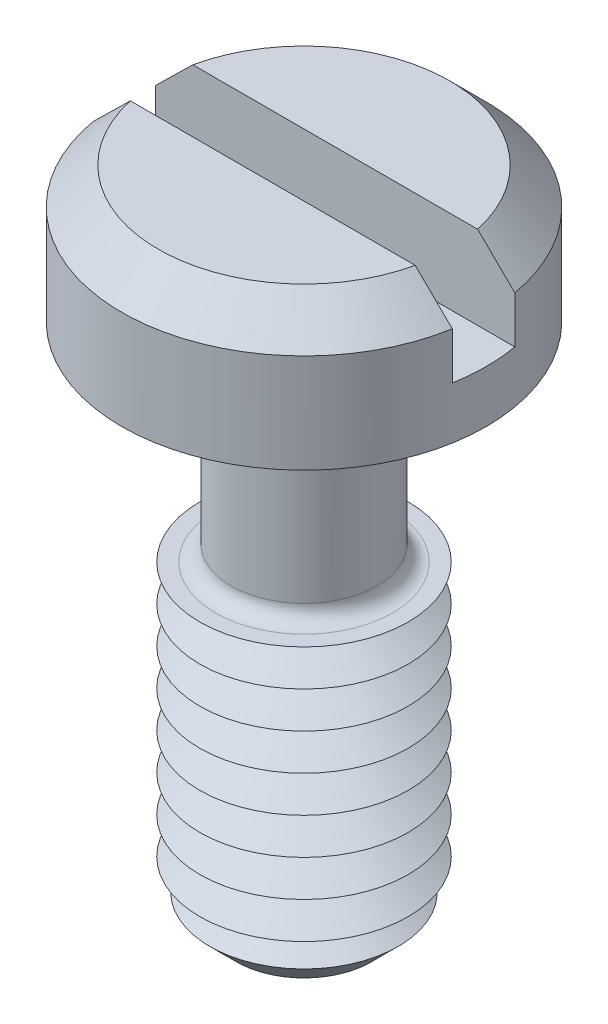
ISO-10303-21;
HEADER;
FILE_DESCRIPTION(('STEP AP214'),'2;1');
FILE_NAME('part.step','',(''),(''),'','','');
FILE_SCHEMA(('AUTOMOTIVE_DESIGN { 1 0 10303 214 1 1 1 1 }'));
ENDSEC;
DATA;
#1=APPLICATION_CONTEXT('core data for automotive mechanical design processes');
#2=APPLICATION_PROTOCOL_DEFINITION('international standard','automotive_design',2000,#1);
#3=PRODUCT_CONTEXT('',#1,'mechanical');
#4=PRODUCT('Part','Part','',(#3));
#5=PRODUCT_RELATED_PRODUCT_CATEGORY('part','',(#4));
#6=PRODUCT_DEFINITION_FORMATION('','',#4);
#7=PRODUCT_DEFINITION_CONTEXT('part definition',#1,'design');
#8=PRODUCT_DEFINITION('design','',#6,#7);
#9=PRODUCT_DEFINITION_SHAPE('','',#8);
#10=(LENGTH_UNIT() NAMED_UNIT(*) SI_UNIT(.MILLI.,.METRE.));
#11=(NAMED_UNIT(*) PLANE_ANGLE_UNIT() SI_UNIT($,.RADIAN.));
#12=(NAMED_UNIT(*) SI_UNIT($,.STERADIAN.) SOLID_ANGLE_UNIT());
#13=UNCERTAINTY_MEASURE_WITH_UNIT(LENGTH_MEASURE(1.E-05),#10,'distance_accuracy_value','');
#14=(GEOMETRIC_REPRESENTATION_CONTEXT(3) GLOBAL_UNCERTAINTY_ASSIGNED_CONTEXT((#13)) GLOBAL_UNIT_ASSIGNED_CONTEXT((#10,
#11,#12)) REPRESENTATION_CONTEXT('',''));
#15=CARTESIAN_POINT('',(0.,0.,0.));
#16=DIRECTION('',(0.,0.,1.));
#17=DIRECTION('',(1.,0.,0.));
#18=AXIS2_PLACEMENT_3D('',#15,#16,#17);
#19=CARTESIAN_POINT('',(0.,2.6,0.));
#20=DIRECTION('',(0.,1.,0.));
#21=DIRECTION('',(0.,0.,1.));
#22=AXIS2_PLACEMENT_3D('',#19,#20,#21);
#23=PLANE('',#22);
#24=DIRECTION('',(-1.,0.,0.));
#25=VECTOR('',#24,1.);
#26=CARTESIAN_POINT('',(3.5,2.6,-0.6));
#27=LINE('',#26,#25);
#28=CARTESIAN_POINT('',(2.73495886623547,2.6,-0.6));
#29=VERTEX_POINT('',#28);
#30=CARTESIAN_POINT('',(-2.73495886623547,2.6,-0.6));
#31=VERTEX_POINT('',#30);
#32=EDGE_CURVE('E110',#29,#31,#27,.T.);
#33=ORIENTED_EDGE('',*,*,#32,.F.);
#34=CARTESIAN_POINT('',(0.,2.6,0.));
#35=DIRECTION('',(0.,1.,0.));
#36=DIRECTION('',(0.,0.,1.));
#37=AXIS2_PLACEMENT_3D('',#34,#35,#36);
#38=CIRCLE('',#37,2.8);
#39=EDGE_CURVE('E113',#29,#31,#38,.T.);
#40=ORIENTED_EDGE('',*,*,#39,.T.);
#41=EDGE_LOOP('',(#33,#40));
#42=FACE_BOUND('',#41,.T.);
#43=ADVANCED_FACE('F39',(#42),#23,.T.);
#44=CARTESIAN_POINT('',(0.,2.6,0.));
#45=DIRECTION('',(0.,-1.,0.));
#46=DIRECTION('',(0.,0.,-1.));
#47=AXIS2_PLACEMENT_3D('',#44,#45,#46);
#48=CONICAL_SURFACE('',#47,2.8,0.785398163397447);
#49=CARTESIAN_POINT('',(7.69779986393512,-2.32114776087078,-0.6));
#50=CARTESIAN_POINT('',(7.42456340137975,-2.0487448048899,-0.6));
#51=CARTESIAN_POINT('',(7.15128998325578,-1.77637887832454,-0.6));
#52=CARTESIAN_POINT('',(6.60460779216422,-1.23176088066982,-0.6));
#53=CARTESIAN_POINT('',(6.33119901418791,-0.959508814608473,-0.6));
#54=CARTESIAN_POINT('',(5.78393918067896,-0.414914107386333,-0.6));
#55=CARTESIAN_POINT('',(5.5100879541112,-0.14257163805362,-0.6));
#56=CARTESIAN_POINT('',(4.9621249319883,0.401829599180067,-0.6));
#57=CARTESIAN_POINT('',(4.68801314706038,0.673888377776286,-0.6));
#58=CARTESIAN_POINT('',(4.15230810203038,1.20471714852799,-0.6));
#59=CARTESIAN_POINT('',(3.89073524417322,1.4635077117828,-0.6));
#60=CARTESIAN_POINT('',(3.49781694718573,1.85115830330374,-0.6));
#61=CARTESIAN_POINT('',(3.36674319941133,1.98029362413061,-0.6));
#62=CARTESIAN_POINT('',(3.10433907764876,2.23830030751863,-0.6));
#63=CARTESIAN_POINT('',(2.97300870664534,2.36717167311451,-0.6));
#64=CARTESIAN_POINT('',(2.71005235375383,2.62445652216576,-0.6));
#65=CARTESIAN_POINT('',(2.57842659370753,2.75287023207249,-0.6));
#66=CARTESIAN_POINT('',(2.31459302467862,3.00911021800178,-0.6));
#67=CARTESIAN_POINT('',(2.1823851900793,3.13693646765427,-0.6));
#68=CARTESIAN_POINT('',(1.91706128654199,3.39159289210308,-0.6));
#69=CARTESIAN_POINT('',(1.78394541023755,3.51842326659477,-0.6));
#70=CARTESIAN_POINT('',(1.5829745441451,3.70728046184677,-0.6));
#71=CARTESIAN_POINT('',(1.51577053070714,3.76999922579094,-0.6));
#72=CARTESIAN_POINT('',(1.38073587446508,3.89475766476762,-0.6));
#73=CARTESIAN_POINT('',(1.31290524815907,3.95679735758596,-0.6));
#74=CARTESIAN_POINT('',(1.20662362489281,4.05253127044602,-0.6));
#75=CARTESIAN_POINT('',(1.16849592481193,4.08658409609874,-0.6));
#76=CARTESIAN_POINT('',(1.09186306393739,4.15427097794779,-0.6));
#77=CARTESIAN_POINT('',(1.05335786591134,4.18790499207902,-0.6));
#78=CARTESIAN_POINT('',(0.975560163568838,4.25487029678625,-0.6));
#79=CARTESIAN_POINT('',(0.936263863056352,4.28819718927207,-0.6));
#80=CARTESIAN_POINT('',(0.857023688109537,4.35405392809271,-0.6));
#81=CARTESIAN_POINT('',(0.817079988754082,4.38658398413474,-0.6));
#82=CARTESIAN_POINT('',(0.735932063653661,4.45080389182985,-0.6));
#83=CARTESIAN_POINT('',(0.694719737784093,4.48248357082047,-0.6));
#84=CARTESIAN_POINT('',(0.611023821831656,4.54411116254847,-0.6));
#85=CARTESIAN_POINT('',(0.568540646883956,4.57405963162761,-0.6));
#86=CARTESIAN_POINT('',(0.482031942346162,4.63104137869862,-0.6));
#87=CARTESIAN_POINT('',(0.438018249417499,4.65809235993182,-0.6));
#88=CARTESIAN_POINT('',(0.347545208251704,4.70764477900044,-0.6));
#89=CARTESIAN_POINT('',(0.301093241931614,4.73015905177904,-0.6));
#90=CARTESIAN_POINT('',(0.21684063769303,4.76288589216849,-0.6));
#91=CARTESIAN_POINT('',(0.179711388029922,4.77476119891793,-0.6));
#92=CARTESIAN_POINT('',(0.104069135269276,4.79214056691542,-0.6));
#93=CARTESIAN_POINT('',(0.0655630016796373,4.79767265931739,-0.6));
#94=CARTESIAN_POINT('',(-0.0121083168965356,4.80113734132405,-0.6));
#95=CARTESIAN_POINT('',(-0.051276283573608,4.79901215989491,-0.6));
#96=CARTESIAN_POINT('',(-0.128601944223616,4.78758103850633,-0.6));
#97=CARTESIAN_POINT('',(-0.166755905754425,4.77825158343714,-0.6));
#98=CARTESIAN_POINT('',(-0.239985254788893,4.75468984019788,-0.6));
#99=CARTESIAN_POINT('',(-0.275121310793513,4.74063623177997,-0.6));
#100=CARTESIAN_POINT('',(-0.343859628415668,4.70912771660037,-0.6));
#101=CARTESIAN_POINT('',(-0.377459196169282,4.6916670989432,-0.6));
#102=CARTESIAN_POINT('',(-0.443620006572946,4.65431398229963,-0.6));
#103=CARTESIAN_POINT('',(-0.476170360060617,4.63440256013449,-0.6));
#104=CARTESIAN_POINT('',(-0.540208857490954,4.59301144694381,-0.6));
#105=CARTESIAN_POINT('',(-0.571697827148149,4.57153301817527,-0.6));
#106=CARTESIAN_POINT('',(-0.636426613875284,4.5256571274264,-0.6));
#107=CARTESIAN_POINT('',(-0.669598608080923,4.50116466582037,-0.6));
#108=CARTESIAN_POINT('',(-0.735238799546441,4.45125092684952,-0.6));
#109=CARTESIAN_POINT('',(-0.767706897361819,4.42582951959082,-0.6));
#110=CARTESIAN_POINT('',(-0.864340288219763,4.34853769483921,-0.6));
#111=CARTESIAN_POINT('',(-0.927700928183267,4.29566444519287,-0.6));
#112=CARTESIAN_POINT('',(-1.05322030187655,4.18829389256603,-0.6));
#113=CARTESIAN_POINT('',(-1.11537654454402,4.13379371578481,-0.6));
#114=CARTESIAN_POINT('',(-1.23879800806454,4.02383276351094,-0.6));
#115=CARTESIAN_POINT('',(-1.30006349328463,3.96837228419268,-0.6));
#116=CARTESIAN_POINT('',(-1.42182653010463,3.85695373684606,-0.6));
#117=CARTESIAN_POINT('',(-1.48232573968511,3.80099747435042,-0.6));
#118=CARTESIAN_POINT('',(-1.602900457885,3.68862177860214,-0.6));
#119=CARTESIAN_POINT('',(-1.66297593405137,3.63220231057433,-0.6));
#120=CARTESIAN_POINT('',(-1.84259490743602,3.46258196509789,-0.6));
#121=CARTESIAN_POINT('',(-1.96167258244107,3.34888831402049,-0.6));
#122=CARTESIAN_POINT('',(-2.19942862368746,3.12043467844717,-0.6));
#123=CARTESIAN_POINT('',(-2.31810499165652,3.00567262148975,-0.6));
#124=CARTESIAN_POINT('',(-2.55498513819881,2.77566147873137,-0.6));
#125=CARTESIAN_POINT('',(-2.67318891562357,2.66041239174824,-0.6));
#126=CARTESIAN_POINT('',(-3.02733776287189,2.31418176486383,-0.6));
#127=CARTESIAN_POINT('',(-3.26281496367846,2.08272206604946,-0.6));
#128=CARTESIAN_POINT('',(-3.7332660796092,1.61902814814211,-0.6));
#129=CARTESIAN_POINT('',(-3.96823963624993,1.38679356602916,-0.6));
#130=CARTESIAN_POINT('',(-4.43780370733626,0.921942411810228,-0.6));
#131=CARTESIAN_POINT('',(-4.67239422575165,0.689325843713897,-0.6));
#132=CARTESIAN_POINT('',(-5.13982382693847,0.225350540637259,-0.6));
#133=CARTESIAN_POINT('',(-5.37266445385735,-0.00600663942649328,-0.6));
#134=CARTESIAN_POINT('',(-5.83818541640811,-0.468883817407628,-0.6));
#135=CARTESIAN_POINT('',(-6.07086575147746,-0.700403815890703,-0.6));
#136=CARTESIAN_POINT('',(-6.53596926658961,-1.16341429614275,-0.6));
#137=CARTESIAN_POINT('',(-6.76839251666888,-1.39490470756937,-0.6));
#138=CARTESIAN_POINT('',(-7.23315324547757,-1.85796986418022,-0.6));
#139=CARTESIAN_POINT('',(-7.46549072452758,-2.08954460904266,-0.6));
#140=CARTESIAN_POINT('',(-7.69779986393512,-2.32114776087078,-0.6));
#141=B_SPLINE_CURVE_WITH_KNOTS('',3,(#49,#50,#51,#52,#53,#54,#55,#56,#57,#58,#59,#60,#61,#62,
#63,#64,#65,#66,#67,#68,#69,#70,#71,#72,#73,#74,#75,#76,#77,#78,#79,#80,#81,#82,#83,#84,#85,#86,
#87,#88,#89,#90,#91,#92,#93,#94,#95,#96,#97,#98,#99,#100,#101,#102,#103,#104,#105,#106,#107,
#108,#109,#110,#111,#112,#113,#114,#115,#116,#117,#118,#119,#120,#121,#122,#123,#124,#125,#126,
#127,#128,#129,#130,#131,#132,#133,#134,#135,#136,#137,#138,#139,#140),.UNSPECIFIED.,.F.,.F.,(4,
2,2,2,2,2,2,2,2,2,2,2,2,2,2,2,2,2,2,2,2,2,2,2,2,2,2,2,2,2,2,2,2,2,2,2,2,2,2,2,2,2,2,2,2,4),(0.,
1.15747738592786,2.31500139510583,3.47365747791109,4.6322681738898,5.73614050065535,
6.28814234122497,6.84013779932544,7.39180548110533,7.94349768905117,8.49507629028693,
8.77084567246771,9.04660781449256,9.19996738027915,9.35334222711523,9.50791164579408,
9.66243993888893,9.81835637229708,9.9742224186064,10.1290741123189,10.2834813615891,
10.4000294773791,10.5160605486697,10.6329688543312,10.7502603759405,10.8635386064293,
10.9770083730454,11.0914168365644,11.205734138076,11.3294140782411,11.4531113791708,
11.7006314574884,11.9486181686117,12.1965297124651,12.4437540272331,12.6909970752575,
13.184904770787,13.6801705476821,14.1754375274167,15.1659939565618,16.1571087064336,
17.1482131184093,18.1329303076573,19.1176509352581,20.1017623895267,21.0858701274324),.UNSPECIFIED.);
#142=CARTESIAN_POINT('',(3.44818792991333,1.9,-0.6));
#143=VERTEX_POINT('',#142);
#144=EDGE_CURVE('E260',#143,#29,#141,.T.);
#145=ORIENTED_EDGE('',*,*,#144,.F.);
#146=CARTESIAN_POINT('',(0.,1.9,0.));
#147=DIRECTION('',(0.,1.,0.));
#148=DIRECTION('',(0.,0.,1.));
#149=AXIS2_PLACEMENT_3D('',#146,#147,#148);
#150=CIRCLE('',#149,3.5);
#151=CARTESIAN_POINT('',(-3.44818792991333,1.9,-0.6));
#152=VERTEX_POINT('',#151);
#153=EDGE_CURVE('E128',#152,#143,#150,.F.);
#154=ORIENTED_EDGE('',*,*,#153,.F.);
#155=EDGE_CURVE('E102',#31,#152,#141,.T.);
#156=ORIENTED_EDGE('',*,*,#155,.F.);
#157=ORIENTED_EDGE('',*,*,#39,.F.);
#158=EDGE_LOOP('',(#145,#154,#156,#157));
#159=FACE_BOUND('',#158,.T.);
#160=ADVANCED_FACE('F222',(#159),#48,.T.);
#161=CARTESIAN_POINT('',(0.,-10.,0.));
#162=DIRECTION('',(0.,1.,0.));
#163=DIRECTION('',(0.,0.,1.));
#164=AXIS2_PLACEMENT_3D('',#161,#162,#163);
#165=CYLINDRICAL_SURFACE('',#164,1.4);
#166=CARTESIAN_POINT('',(0.,-3.7,0.));
#167=DIRECTION('',(0.,-1.,0.));
#168=DIRECTION('',(0.,0.,-1.));
#169=AXIS2_PLACEMENT_3D('',#166,#167,#168);
#170=CIRCLE('',#169,1.4);
#171=CARTESIAN_POINT('',(0.,-3.7,-1.4));
#172=VERTEX_POINT('',#171);
#173=EDGE_CURVE('E123',#172,#172,#170,.F.);
#174=ORIENTED_EDGE('',*,*,#173,.T.);
#175=EDGE_LOOP('',(#174));
#176=FACE_BOUND('',#175,.T.);
#177=CARTESIAN_POINT('',(0.,-0.3,0.));
#178=DIRECTION('',(0.,1.,0.));
#179=DIRECTION('',(0.,0.,1.));
#180=AXIS2_PLACEMENT_3D('',#177,#178,#179);
#181=CIRCLE('',#180,1.4);
#182=CARTESIAN_POINT('',(0.,-0.3,1.4));
#183=VERTEX_POINT('',#182);
#184=EDGE_CURVE('E365',#183,#183,#181,.F.);
#185=ORIENTED_EDGE('',*,*,#184,.T.);
#186=EDGE_LOOP('',(#185));
#187=FACE_BOUND('',#186,.T.);
#188=ADVANCED_FACE('F218',(#176,#187),#165,.T.);
#189=CARTESIAN_POINT('',(0.,2.6,0.));
#190=DIRECTION('',(0.,-1.,0.));
#191=DIRECTION('',(0.,0.,-1.));
#192=AXIS2_PLACEMENT_3D('',#189,#190,#191);
#193=CYLINDRICAL_SURFACE('',#192,3.5);
#194=ORIENTED_EDGE('',*,*,#153,.T.);
#195=DIRECTION('',(0.,-1.,0.));
#196=VECTOR('',#195,1.);
#197=CARTESIAN_POINT('',(3.44818792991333,2.6,-0.6));
#198=LINE('',#197,#196);
#199=CARTESIAN_POINT('',(3.44818792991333,1.,-0.6));
#200=VERTEX_POINT('',#199);
#201=EDGE_CURVE('E64',#143,#200,#198,.T.);
#202=ORIENTED_EDGE('',*,*,#201,.T.);
#203=CARTESIAN_POINT('',(0.,1.,0.));
#204=DIRECTION('',(0.,1.,0.));
#205=DIRECTION('',(0.,0.,1.));
#206=AXIS2_PLACEMENT_3D('',#203,#204,#205);
#207=CIRCLE('',#206,3.5);
#208=CARTESIAN_POINT('',(3.44818792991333,1.,0.6));
#209=VERTEX_POINT('',#208);
#210=EDGE_CURVE('E11',#209,#200,#207,.T.);
#211=ORIENTED_EDGE('',*,*,#210,.F.);
#212=DIRECTION('',(0.,-1.,0.));
#213=VECTOR('',#212,1.);
#214=CARTESIAN_POINT('',(3.44818792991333,2.6,0.6));
#215=LINE('',#214,#213);
#216=CARTESIAN_POINT('',(3.44818792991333,1.9,0.6));
#217=VERTEX_POINT('',#216);
#218=EDGE_CURVE('E275',#209,#217,#215,.F.);
#219=ORIENTED_EDGE('',*,*,#218,.T.);
#220=CARTESIAN_POINT('',(-3.44818792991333,1.9,0.6));
#221=VERTEX_POINT('',#220);
#222=EDGE_CURVE('E120',#217,#221,#150,.F.);
#223=ORIENTED_EDGE('',*,*,#222,.T.);
#224=DIRECTION('',(0.,-1.,0.));
#225=VECTOR('',#224,1.);
#226=CARTESIAN_POINT('',(-3.44818792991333,2.6,0.6));
#227=LINE('',#226,#225);
#228=CARTESIAN_POINT('',(-3.44818792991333,1.,0.6));
#229=VERTEX_POINT('',#228);
#230=EDGE_CURVE('E96',#221,#229,#227,.T.);
#231=ORIENTED_EDGE('',*,*,#230,.T.);
#232=CARTESIAN_POINT('',(-3.44818792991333,1.,-0.6));
#233=VERTEX_POINT('',#232);
#234=EDGE_CURVE('E44',#233,#229,#207,.T.);
#235=ORIENTED_EDGE('',*,*,#234,.F.);
#236=DIRECTION('',(0.,-1.,0.));
#237=VECTOR('',#236,1.);
#238=CARTESIAN_POINT('',(-3.44818792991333,2.6,-0.6));
#239=LINE('',#238,#237);
#240=EDGE_CURVE('E280',#233,#152,#239,.F.);
#241=ORIENTED_EDGE('',*,*,#240,.T.);
#242=EDGE_LOOP('',(#194,#202,#211,#219,#223,#231,#235,#241));
#243=FACE_BOUND('',#242,.T.);
#244=CARTESIAN_POINT('',(0.,0.,0.));
#245=DIRECTION('',(0.,1.,0.));
#246=DIRECTION('',(0.,0.,1.));
#247=AXIS2_PLACEMENT_3D('',#244,#245,#246);
#248=CIRCLE('',#247,3.5);
#249=CARTESIAN_POINT('',(0.,0.,3.5));
#250=VERTEX_POINT('',#249);
#251=EDGE_CURVE('E351',#250,#250,#248,.T.);
#252=ORIENTED_EDGE('',*,*,#251,.T.);
#253=EDGE_LOOP('',(#252));
#254=FACE_BOUND('',#253,.T.);
#255=ADVANCED_FACE('F221',(#243,#254),#193,.T.);
#256=DIRECTION('',(1.,0.,0.));
#257=VECTOR('',#256,1.);
#258=CARTESIAN_POINT('',(3.5,2.6,0.6));
#259=LINE('',#258,#257);
#260=CARTESIAN_POINT('',(-2.73495886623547,2.6,0.6));
#261=VERTEX_POINT('',#260);
#262=CARTESIAN_POINT('',(2.73495886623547,2.6,0.6));
#263=VERTEX_POINT('',#262);
#264=EDGE_CURVE('E56',#261,#263,#259,.T.);
#265=ORIENTED_EDGE('',*,*,#264,.F.);
#266=EDGE_CURVE('E108',#261,#263,#38,.T.);
#267=ORIENTED_EDGE('',*,*,#266,.T.);
#268=EDGE_LOOP('',(#265,#267));
#269=FACE_BOUND('',#268,.T.);
#270=ADVANCED_FACE('F107',(#269),#23,.T.);
#271=CARTESIAN_POINT('',(0.,0.,0.));
#272=DIRECTION('',(0.,1.,0.));
#273=DIRECTION('',(0.,0.,1.));
#274=AXIS2_PLACEMENT_3D('',#271,#272,#273);
#275=PLANE('',#274);
#276=CARTESIAN_POINT('',(0.,0.,0.));
#277=DIRECTION('',(0.,1.,0.));
#278=DIRECTION('',(0.,0.,1.));
#279=AXIS2_PLACEMENT_3D('',#276,#277,#278);
#280=CIRCLE('',#279,1.7);
#281=CARTESIAN_POINT('',(0.,0.,1.7));
#282=VERTEX_POINT('',#281);
#283=EDGE_CURVE('E114',#282,#282,#280,.T.);
#284=ORIENTED_EDGE('',*,*,#283,.T.);
#285=EDGE_LOOP('',(#284));
#286=FACE_BOUND('',#285,.T.);
#287=ORIENTED_EDGE('',*,*,#251,.F.);
#288=EDGE_LOOP('',(#287));
#289=FACE_BOUND('',#288,.T.);
#290=ADVANCED_FACE('F212',(#286,#289),#275,.F.);
#291=CARTESIAN_POINT('',(0.,-4.,0.));
#292=DIRECTION('',(0.,-1.,0.));
#293=DIRECTION('',(0.,0.,-1.));
#294=AXIS2_PLACEMENT_3D('',#291,#292,#293);
#295=PLANE('',#294);
#296=CARTESIAN_POINT('',(0.,-4.,0.));
#297=DIRECTION('',(0.,-1.,0.));
#298=DIRECTION('',(0.,0.,-1.));
#299=AXIS2_PLACEMENT_3D('',#296,#297,#298);
#300=CIRCLE('',#299,1.7);
#301=CARTESIAN_POINT('',(0.,-4.,-1.7));
#302=VERTEX_POINT('',#301);
#303=EDGE_CURVE('E359',#302,#302,#300,.T.);
#304=ORIENTED_EDGE('',*,*,#303,.T.);
#305=EDGE_LOOP('',(#304));
#306=FACE_BOUND('',#305,.T.);
#307=CARTESIAN_POINT('',(0.,-4.,0.));
#308=DIRECTION('',(0.,1.,0.));
#309=DIRECTION('',(0.,0.,1.));
#310=AXIS2_PLACEMENT_3D('',#307,#308,#309);
#311=CIRCLE('',#310,2.);
#312=CARTESIAN_POINT('',(0.,-4.,2.));
#313=VERTEX_POINT('',#312);
#314=EDGE_CURVE('E347',#313,#313,#311,.T.);
#315=ORIENTED_EDGE('',*,*,#314,.T.);
#316=EDGE_LOOP('',(#315));
#317=FACE_BOUND('',#316,.T.);
#318=ADVANCED_FACE('F208',(#306,#317),#295,.F.);
#319=CARTESIAN_POINT('',(0.,-4.35,0.));
#320=DIRECTION('',(0.,1.,0.));
#321=DIRECTION('',(0.,0.,1.));
#322=AXIS2_PLACEMENT_3D('',#319,#320,#321);
#323=CONICAL_SURFACE('',#322,1.39378221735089,1.0471975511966);
#324=ORIENTED_EDGE('',*,*,#314,.F.);
#325=EDGE_LOOP('',(#324));
#326=FACE_BOUND('',#325,.T.);
#327=CARTESIAN_POINT('',(0.,-4.35,0.));
#328=DIRECTION('',(0.,1.,0.));
#329=DIRECTION('',(0.,0.,1.));
#330=AXIS2_PLACEMENT_3D('',#327,#328,#329);
#331=CIRCLE('',#330,1.39378221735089);
#332=CARTESIAN_POINT('',(0.,-4.35,1.39378221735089));
#333=VERTEX_POINT('',#332);
#334=EDGE_CURVE('E343',#333,#333,#331,.T.);
#335=ORIENTED_EDGE('',*,*,#334,.T.);
#336=EDGE_LOOP('',(#335));
#337=FACE_BOUND('',#336,.T.);
#338=ADVANCED_FACE('F204',(#326,#337),#323,.T.);
#339=CARTESIAN_POINT('',(0.,-4.7,0.));
#340=DIRECTION('',(0.,-1.,0.));
#341=DIRECTION('',(0.,0.,-1.));
#342=AXIS2_PLACEMENT_3D('',#339,#340,#341);
#343=CONICAL_SURFACE('',#342,2.,1.0471975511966);
#344=ORIENTED_EDGE('',*,*,#334,.F.);
#345=EDGE_LOOP('',(#344));
#346=FACE_BOUND('',#345,.T.);
#347=CARTESIAN_POINT('',(0.,-4.7,0.));
#348=DIRECTION('',(0.,1.,0.));
#349=DIRECTION('',(0.,0.,1.));
#350=AXIS2_PLACEMENT_3D('',#347,#348,#349);
#351=CIRCLE('',#350,2.);
#352=CARTESIAN_POINT('',(0.,-4.7,2.));
#353=VERTEX_POINT('',#352);
#354=EDGE_CURVE('E339',#353,#353,#351,.T.);
#355=ORIENTED_EDGE('',*,*,#354,.T.);
#356=EDGE_LOOP('',(#355));
#357=FACE_BOUND('',#356,.T.);
#358=ADVANCED_FACE('F200',(#346,#357),#343,.T.);
#359=CARTESIAN_POINT('',(0.,-5.05,0.));
#360=DIRECTION('',(0.,1.,0.));
#361=DIRECTION('',(0.,0.,1.));
#362=AXIS2_PLACEMENT_3D('',#359,#360,#361);
#363=CONICAL_SURFACE('',#362,1.39378221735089,1.0471975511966);
#364=ORIENTED_EDGE('',*,*,#354,.F.);
#365=EDGE_LOOP('',(#364));
#366=FACE_BOUND('',#365,.T.);
#367=CARTESIAN_POINT('',(0.,-5.05,0.));
#368=DIRECTION('',(0.,1.,0.));
#369=DIRECTION('',(0.,0.,1.));
#370=AXIS2_PLACEMENT_3D('',#367,#368,#369);
#371=CIRCLE('',#370,1.39378221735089);
#372=CARTESIAN_POINT('',(0.,-5.05,1.39378221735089));
#373=VERTEX_POINT('',#372);
#374=EDGE_CURVE('E336',#373,#373,#371,.T.);
#375=ORIENTED_EDGE('',*,*,#374,.T.);
#376=EDGE_LOOP('',(#375));
#377=FACE_BOUND('',#376,.T.);
#378=ADVANCED_FACE('F196',(#366,#377),#363,.T.);
#379=CARTESIAN_POINT('',(0.,-5.4,0.));
#380=DIRECTION('',(0.,-1.,0.));
#381=DIRECTION('',(0.,0.,-1.));
#382=AXIS2_PLACEMENT_3D('',#379,#380,#381);
#383=CONICAL_SURFACE('',#382,2.,1.0471975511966);
#384=ORIENTED_EDGE('',*,*,#374,.F.);
#385=EDGE_LOOP('',(#384));
#386=FACE_BOUND('',#385,.T.);
#387=CARTESIAN_POINT('',(0.,-5.4,0.));
#388=DIRECTION('',(0.,1.,0.));
#389=DIRECTION('',(0.,0.,1.));
#390=AXIS2_PLACEMENT_3D('',#387,#388,#389);
#391=CIRCLE('',#390,2.);
#392=CARTESIAN_POINT('',(0.,-5.4,2.));
#393=VERTEX_POINT('',#392);
#394=EDGE_CURVE('E332',#393,#393,#391,.T.);
#395=ORIENTED_EDGE('',*,*,#394,.T.);
#396=EDGE_LOOP('',(#395));
#397=FACE_BOUND('',#396,.T.);
#398=ADVANCED_FACE('F192',(#386,#397),#383,.T.);
#399=CARTESIAN_POINT('',(0.,-5.75,0.));
#400=DIRECTION('',(0.,1.,0.));
#401=DIRECTION('',(0.,0.,1.));
#402=AXIS2_PLACEMENT_3D('',#399,#400,#401);
#403=CONICAL_SURFACE('',#402,1.39378221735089,1.0471975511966);
#404=ORIENTED_EDGE('',*,*,#394,.F.);
#405=EDGE_LOOP('',(#404));
#406=FACE_BOUND('',#405,.T.);
#407=CARTESIAN_POINT('',(0.,-5.75,0.));
#408=DIRECTION('',(0.,1.,0.));
#409=DIRECTION('',(0.,0.,1.));
#410=AXIS2_PLACEMENT_3D('',#407,#408,#409);
#411=CIRCLE('',#410,1.39378221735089);
#412=CARTESIAN_POINT('',(0.,-5.75,1.39378221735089));
#413=VERTEX_POINT('',#412);
#414=EDGE_CURVE('E328',#413,#413,#411,.T.);
#415=ORIENTED_EDGE('',*,*,#414,.T.);
#416=EDGE_LOOP('',(#415));
#417=FACE_BOUND('',#416,.T.);
#418=ADVANCED_FACE('F188',(#406,#417),#403,.T.);
#419=CARTESIAN_POINT('',(0.,-6.1,0.));
#420=DIRECTION('',(0.,-1.,0.));
#421=DIRECTION('',(0.,0.,-1.));
#422=AXIS2_PLACEMENT_3D('',#419,#420,#421);
#423=CONICAL_SURFACE('',#422,2.,1.0471975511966);
#424=ORIENTED_EDGE('',*,*,#414,.F.);
#425=EDGE_LOOP('',(#424));
#426=FACE_BOUND('',#425,.T.);
#427=CARTESIAN_POINT('',(0.,-6.1,0.));
#428=DIRECTION('',(0.,1.,0.));
#429=DIRECTION('',(0.,0.,1.));
#430=AXIS2_PLACEMENT_3D('',#427,#428,#429);
#431=CIRCLE('',#430,2.);
#432=CARTESIAN_POINT('',(0.,-6.1,2.));
#433=VERTEX_POINT('',#432);
#434=EDGE_CURVE('E325',#433,#433,#431,.T.);
#435=ORIENTED_EDGE('',*,*,#434,.T.);
#436=EDGE_LOOP('',(#435));
#437=FACE_BOUND('',#436,.T.);
#438=ADVANCED_FACE('F184',(#426,#437),#423,.T.);
#439=CARTESIAN_POINT('',(0.,-6.45,0.));
#440=DIRECTION('',(0.,1.,0.));
#441=DIRECTION('',(0.,0.,1.));
#442=AXIS2_PLACEMENT_3D('',#439,#440,#441);
#443=CONICAL_SURFACE('',#442,1.39378221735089,1.0471975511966);
#444=ORIENTED_EDGE('',*,*,#434,.F.);
#445=EDGE_LOOP('',(#444));
#446=FACE_BOUND('',#445,.T.);
#447=CARTESIAN_POINT('',(0.,-6.45,0.));
#448=DIRECTION('',(0.,1.,0.));
#449=DIRECTION('',(0.,0.,1.));
#450=AXIS2_PLACEMENT_3D('',#447,#448,#449);
#451=CIRCLE('',#450,1.39378221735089);
#452=CARTESIAN_POINT('',(0.,-6.45,1.39378221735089));
#453=VERTEX_POINT('',#452);
#454=EDGE_CURVE('E321',#453,#453,#451,.T.);
#455=ORIENTED_EDGE('',*,*,#454,.T.);
#456=EDGE_LOOP('',(#455));
#457=FACE_BOUND('',#456,.T.);
#458=ADVANCED_FACE('F180',(#446,#457),#443,.T.);
#459=CARTESIAN_POINT('',(0.,-6.8,0.));
#460=DIRECTION('',(0.,-1.,0.));
#461=DIRECTION('',(0.,0.,-1.));
#462=AXIS2_PLACEMENT_3D('',#459,#460,#461);
#463=CONICAL_SURFACE('',#462,2.,1.0471975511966);
#464=ORIENTED_EDGE('',*,*,#454,.F.);
#465=EDGE_LOOP('',(#464));
#466=FACE_BOUND('',#465,.T.);
#467=CARTESIAN_POINT('',(0.,-6.8,0.));
#468=DIRECTION('',(0.,1.,0.));
#469=DIRECTION('',(0.,0.,1.));
#470=AXIS2_PLACEMENT_3D('',#467,#468,#469);
#471=CIRCLE('',#470,2.);
#472=CARTESIAN_POINT('',(0.,-6.8,2.));
#473=VERTEX_POINT('',#472);
#474=EDGE_CURVE('E318',#473,#473,#471,.T.);
#475=ORIENTED_EDGE('',*,*,#474,.T.);
#476=EDGE_LOOP('',(#475));
#477=FACE_BOUND('',#476,.T.);
#478=ADVANCED_FACE('F176',(#466,#477),#463,.T.);
#479=CARTESIAN_POINT('',(0.,-7.15,0.));
#480=DIRECTION('',(0.,1.,0.));
#481=DIRECTION('',(0.,0.,1.));
#482=AXIS2_PLACEMENT_3D('',#479,#480,#481);
#483=CONICAL_SURFACE('',#482,1.39378221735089,1.0471975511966);
#484=ORIENTED_EDGE('',*,*,#474,.F.);
#485=EDGE_LOOP('',(#484));
#486=FACE_BOUND('',#485,.T.);
#487=CARTESIAN_POINT('',(0.,-7.15,0.));
#488=DIRECTION('',(0.,1.,0.));
#489=DIRECTION('',(0.,0.,1.));
#490=AXIS2_PLACEMENT_3D('',#487,#488,#489);
#491=CIRCLE('',#490,1.39378221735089);
#492=CARTESIAN_POINT('',(0.,-7.15,1.39378221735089));
#493=VERTEX_POINT('',#492);
#494=EDGE_CURVE('E314',#493,#493,#491,.T.);
#495=ORIENTED_EDGE('',*,*,#494,.T.);
#496=EDGE_LOOP('',(#495));
#497=FACE_BOUND('',#496,.T.);
#498=ADVANCED_FACE('F172',(#486,#497),#483,.T.);
#499=CARTESIAN_POINT('',(0.,-7.5,0.));
#500=DIRECTION('',(0.,-1.,0.));
#501=DIRECTION('',(0.,0.,-1.));
#502=AXIS2_PLACEMENT_3D('',#499,#500,#501);
#503=CONICAL_SURFACE('',#502,2.,1.0471975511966);
#504=ORIENTED_EDGE('',*,*,#494,.F.);
#505=EDGE_LOOP('',(#504));
#506=FACE_BOUND('',#505,.T.);
#507=CARTESIAN_POINT('',(0.,-7.5,0.));
#508=DIRECTION('',(0.,1.,0.));
#509=DIRECTION('',(0.,0.,1.));
#510=AXIS2_PLACEMENT_3D('',#507,#508,#509);
#511=CIRCLE('',#510,2.);
#512=CARTESIAN_POINT('',(0.,-7.5,2.));
#513=VERTEX_POINT('',#512);
#514=EDGE_CURVE('E311',#513,#513,#511,.T.);
#515=ORIENTED_EDGE('',*,*,#514,.T.);
#516=EDGE_LOOP('',(#515));
#517=FACE_BOUND('',#516,.T.);
#518=ADVANCED_FACE('F168',(#506,#517),#503,.T.);
#519=CARTESIAN_POINT('',(0.,-7.85,0.));
#520=DIRECTION('',(0.,1.,0.));
#521=DIRECTION('',(0.,0.,1.));
#522=AXIS2_PLACEMENT_3D('',#519,#520,#521);
#523=CONICAL_SURFACE('',#522,1.39378221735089,1.0471975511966);
#524=ORIENTED_EDGE('',*,*,#514,.F.);
#525=EDGE_LOOP('',(#524));
#526=FACE_BOUND('',#525,.T.);
#527=CARTESIAN_POINT('',(0.,-7.85,0.));
#528=DIRECTION('',(0.,1.,0.));
#529=DIRECTION('',(0.,0.,1.));
#530=AXIS2_PLACEMENT_3D('',#527,#528,#529);
#531=CIRCLE('',#530,1.39378221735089);
#532=CARTESIAN_POINT('',(0.,-7.85,1.39378221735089));
#533=VERTEX_POINT('',#532);
#534=EDGE_CURVE('E307',#533,#533,#531,.T.);
#535=ORIENTED_EDGE('',*,*,#534,.T.);
#536=EDGE_LOOP('',(#535));
#537=FACE_BOUND('',#536,.T.);
#538=ADVANCED_FACE('F164',(#526,#537),#523,.T.);
#539=CARTESIAN_POINT('',(0.,-8.2,0.));
#540=DIRECTION('',(0.,-1.,0.));
#541=DIRECTION('',(0.,0.,-1.));
#542=AXIS2_PLACEMENT_3D('',#539,#540,#541);
#543=CONICAL_SURFACE('',#542,2.,1.0471975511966);
#544=ORIENTED_EDGE('',*,*,#534,.F.);
#545=EDGE_LOOP('',(#544));
#546=FACE_BOUND('',#545,.T.);
#547=CARTESIAN_POINT('',(0.,-8.2,0.));
#548=DIRECTION('',(0.,1.,0.));
#549=DIRECTION('',(0.,0.,1.));
#550=AXIS2_PLACEMENT_3D('',#547,#548,#549);
#551=CIRCLE('',#550,2.);
#552=CARTESIAN_POINT('',(0.,-8.2,2.));
#553=VERTEX_POINT('',#552);
#554=EDGE_CURVE('E303',#553,#553,#551,.T.);
#555=ORIENTED_EDGE('',*,*,#554,.T.);
#556=EDGE_LOOP('',(#555));
#557=FACE_BOUND('',#556,.T.);
#558=ADVANCED_FACE('F160',(#546,#557),#543,.T.);
#559=CARTESIAN_POINT('',(0.,-8.55,0.));
#560=DIRECTION('',(0.,1.,0.));
#561=DIRECTION('',(0.,0.,1.));
#562=AXIS2_PLACEMENT_3D('',#559,#560,#561);
#563=CONICAL_SURFACE('',#562,1.39378221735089,1.0471975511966);
#564=ORIENTED_EDGE('',*,*,#554,.F.);
#565=EDGE_LOOP('',(#564));
#566=FACE_BOUND('',#565,.T.);
#567=CARTESIAN_POINT('',(0.,-8.55,0.));
#568=DIRECTION('',(0.,1.,0.));
#569=DIRECTION('',(0.,0.,1.));
#570=AXIS2_PLACEMENT_3D('',#567,#568,#569);
#571=CIRCLE('',#570,1.39378221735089);
#572=CARTESIAN_POINT('',(0.,-8.55,1.39378221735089));
#573=VERTEX_POINT('',#572);
#574=EDGE_CURVE('E299',#573,#573,#571,.T.);
#575=ORIENTED_EDGE('',*,*,#574,.T.);
#576=EDGE_LOOP('',(#575));
#577=FACE_BOUND('',#576,.T.);
#578=ADVANCED_FACE('F156',(#566,#577),#563,.T.);
#579=CARTESIAN_POINT('',(0.,-8.9,0.));
#580=DIRECTION('',(0.,-1.,0.));
#581=DIRECTION('',(0.,0.,-1.));
#582=AXIS2_PLACEMENT_3D('',#579,#580,#581);
#583=CONICAL_SURFACE('',#582,2.,1.0471975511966);
#584=ORIENTED_EDGE('',*,*,#574,.F.);
#585=EDGE_LOOP('',(#584));
#586=FACE_BOUND('',#585,.T.);
#587=CARTESIAN_POINT('',(0.,-8.9,0.));
#588=DIRECTION('',(0.,1.,0.));
#589=DIRECTION('',(0.,0.,1.));
#590=AXIS2_PLACEMENT_3D('',#587,#588,#589);
#591=CIRCLE('',#590,2.);
#592=CARTESIAN_POINT('',(0.,-8.9,2.));
#593=VERTEX_POINT('',#592);
#594=EDGE_CURVE('E294',#593,#593,#591,.T.);
#595=ORIENTED_EDGE('',*,*,#594,.T.);
#596=EDGE_LOOP('',(#595));
#597=FACE_BOUND('',#596,.T.);
#598=ADVANCED_FACE('F152',(#586,#597),#583,.T.);
#599=CARTESIAN_POINT('',(0.,-9.25,0.));
#600=DIRECTION('',(0.,1.,0.));
#601=DIRECTION('',(0.,0.,1.));
#602=AXIS2_PLACEMENT_3D('',#599,#600,#601);
#603=CONICAL_SURFACE('',#602,1.39378221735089,1.0471975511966);
#604=ORIENTED_EDGE('',*,*,#594,.F.);
#605=EDGE_LOOP('',(#604));
#606=FACE_BOUND('',#605,.T.);
#607=CARTESIAN_POINT('',(0.,-9.25,0.));
#608=DIRECTION('',(0.,1.,0.));
#609=DIRECTION('',(0.,0.,1.));
#610=AXIS2_PLACEMENT_3D('',#607,#608,#609);
#611=CIRCLE('',#610,1.39378221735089);
#612=CARTESIAN_POINT('',(0.,-9.25,1.39378221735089));
#613=VERTEX_POINT('',#612);
#614=EDGE_CURVE('E290',#613,#613,#611,.T.);
#615=ORIENTED_EDGE('',*,*,#614,.T.);
#616=EDGE_LOOP('',(#615));
#617=FACE_BOUND('',#616,.T.);
#618=ADVANCED_FACE('F148',(#606,#617),#603,.T.);
#619=CARTESIAN_POINT('',(0.,-9.6,0.));
#620=DIRECTION('',(0.,-1.,0.));
#621=DIRECTION('',(0.,0.,-1.));
#622=AXIS2_PLACEMENT_3D('',#619,#620,#621);
#623=CONICAL_SURFACE('',#622,2.,1.0471975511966);
#624=CARTESIAN_POINT('',(0.,-9.49019237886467,0.));
#625=DIRECTION('',(0.,-1.,0.));
#626=DIRECTION('',(0.,0.,-1.));
#627=AXIS2_PLACEMENT_3D('',#624,#625,#626);
#628=CIRCLE('',#627,1.80980762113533);
#629=CARTESIAN_POINT('',(0.,-9.49019237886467,-1.80980762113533));
#630=VERTEX_POINT('',#629);
#631=EDGE_CURVE('E298',#630,#630,#628,.F.);
#632=ORIENTED_EDGE('',*,*,#631,.T.);
#633=EDGE_LOOP('',(#632));
#634=FACE_BOUND('',#633,.T.);
#635=ORIENTED_EDGE('',*,*,#614,.F.);
#636=EDGE_LOOP('',(#635));
#637=FACE_BOUND('',#636,.T.);
#638=ADVANCED_FACE('F144',(#634,#637),#623,.T.);
#639=CARTESIAN_POINT('',(0.,-10.,0.));
#640=DIRECTION('',(0.,-1.,0.));
#641=DIRECTION('',(0.,0.,-1.));
#642=AXIS2_PLACEMENT_3D('',#639,#640,#641);
#643=PLANE('',#642);
#644=CARTESIAN_POINT('',(0.,-10.,0.));
#645=DIRECTION('',(0.,-1.,0.));
#646=DIRECTION('',(0.,0.,-1.));
#647=AXIS2_PLACEMENT_3D('',#644,#645,#646);
#648=CIRCLE('',#647,1.3);
#649=CARTESIAN_POINT('',(0.,-10.,-1.3));
#650=VERTEX_POINT('',#649);
#651=EDGE_CURVE('E355',#650,#650,#648,.T.);
#652=ORIENTED_EDGE('',*,*,#651,.T.);
#653=EDGE_LOOP('',(#652));
#654=FACE_BOUND('',#653,.T.);
#655=ADVANCED_FACE('F147',(#654),#643,.T.);
#656=CARTESIAN_POINT('',(0.,-10.,0.));
#657=DIRECTION('',(0.,1.,0.));
#658=DIRECTION('',(0.,0.,1.));
#659=AXIS2_PLACEMENT_3D('',#656,#657,#658);
#660=CONICAL_SURFACE('',#659,1.3,0.785398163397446);
#661=ORIENTED_EDGE('',*,*,#631,.F.);
#662=EDGE_LOOP('',(#661));
#663=FACE_BOUND('',#662,.T.);
#664=ORIENTED_EDGE('',*,*,#651,.F.);
#665=EDGE_LOOP('',(#664));
#666=FACE_BOUND('',#665,.T.);
#667=ADVANCED_FACE('F216',(#663,#666),#660,.T.);
#668=CARTESIAN_POINT('',(0.,-3.7,0.));
#669=DIRECTION('',(0.,-1.,0.));
#670=DIRECTION('',(0.,0.,-1.));
#671=AXIS2_PLACEMENT_3D('',#668,#669,#670);
#672=TOROIDAL_SURFACE('',#671,1.7,0.3);
#673=ORIENTED_EDGE('',*,*,#173,.F.);
#674=EDGE_LOOP('',(#673));
#675=FACE_BOUND('',#674,.T.);
#676=ORIENTED_EDGE('',*,*,#303,.F.);
#677=EDGE_LOOP('',(#676));
#678=FACE_BOUND('',#677,.T.);
#679=ADVANCED_FACE('F234',(#675,#678),#672,.F.);
#680=CARTESIAN_POINT('',(0.,-0.3,0.));
#681=DIRECTION('',(0.,1.,0.));
#682=DIRECTION('',(0.,0.,1.));
#683=AXIS2_PLACEMENT_3D('',#680,#681,#682);
#684=TOROIDAL_SURFACE('',#683,1.7,0.3);
#685=ORIENTED_EDGE('',*,*,#283,.F.);
#686=EDGE_LOOP('',(#685));
#687=FACE_BOUND('',#686,.T.);
#688=ORIENTED_EDGE('',*,*,#184,.F.);
#689=EDGE_LOOP('',(#688));
#690=FACE_BOUND('',#689,.T.);
#691=ADVANCED_FACE('F237',(#687,#690),#684,.F.);
#692=CARTESIAN_POINT('',(-7.69779986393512,-2.32114776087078,0.6));
#693=CARTESIAN_POINT('',(-7.42456340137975,-2.0487448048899,0.6));
#694=CARTESIAN_POINT('',(-7.15128998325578,-1.77637887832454,0.6));
#695=CARTESIAN_POINT('',(-6.60460779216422,-1.23176088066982,0.6));
#696=CARTESIAN_POINT('',(-6.33119901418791,-0.959508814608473,0.6));
#697=CARTESIAN_POINT('',(-5.78393918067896,-0.414914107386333,0.6));
#698=CARTESIAN_POINT('',(-5.5100879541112,-0.14257163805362,0.6));
#699=CARTESIAN_POINT('',(-4.9621249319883,0.401829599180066,0.6));
#700=CARTESIAN_POINT('',(-4.68801314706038,0.673888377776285,0.6));
#701=CARTESIAN_POINT('',(-4.15230810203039,1.20471714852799,0.6));
#702=CARTESIAN_POINT('',(-3.89073524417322,1.4635077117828,0.6));
#703=CARTESIAN_POINT('',(-3.49781694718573,1.85115830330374,0.6));
#704=CARTESIAN_POINT('',(-3.36674319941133,1.9802936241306,0.6));
#705=CARTESIAN_POINT('',(-3.10433907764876,2.23830030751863,0.6));
#706=CARTESIAN_POINT('',(-2.97300870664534,2.36717167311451,0.6));
#707=CARTESIAN_POINT('',(-2.71005235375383,2.62445652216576,0.6));
#708=CARTESIAN_POINT('',(-2.57842659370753,2.75287023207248,0.6));
#709=CARTESIAN_POINT('',(-2.31459302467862,3.00911021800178,0.6));
#710=CARTESIAN_POINT('',(-2.18238519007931,3.13693646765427,0.6));
#711=CARTESIAN_POINT('',(-1.91706128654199,3.39159289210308,0.6));
#712=CARTESIAN_POINT('',(-1.78394541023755,3.51842326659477,0.6));
#713=CARTESIAN_POINT('',(-1.58297454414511,3.70728046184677,0.6));
#714=CARTESIAN_POINT('',(-1.51577053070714,3.76999922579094,0.6));
#715=CARTESIAN_POINT('',(-1.38073587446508,3.89475766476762,0.6));
#716=CARTESIAN_POINT('',(-1.31290524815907,3.95679735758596,0.6));
#717=CARTESIAN_POINT('',(-1.20662362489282,4.05253127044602,0.6));
#718=CARTESIAN_POINT('',(-1.16849592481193,4.08658409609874,0.6));
#719=CARTESIAN_POINT('',(-1.09186306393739,4.15427097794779,0.6));
#720=CARTESIAN_POINT('',(-1.05335786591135,4.18790499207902,0.6));
#721=CARTESIAN_POINT('',(-0.975560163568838,4.25487029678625,0.6));
#722=CARTESIAN_POINT('',(-0.936263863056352,4.28819718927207,0.6));
#723=CARTESIAN_POINT('',(-0.857023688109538,4.35405392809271,0.6));
#724=CARTESIAN_POINT('',(-0.817079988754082,4.38658398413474,0.6));
#725=CARTESIAN_POINT('',(-0.735932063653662,4.45080389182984,0.6));
#726=CARTESIAN_POINT('',(-0.694719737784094,4.48248357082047,0.6));
#727=CARTESIAN_POINT('',(-0.611023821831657,4.54411116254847,0.6));
#728=CARTESIAN_POINT('',(-0.568540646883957,4.57405963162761,0.6));
#729=CARTESIAN_POINT('',(-0.482031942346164,4.63104137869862,0.6));
#730=CARTESIAN_POINT('',(-0.438018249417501,4.65809235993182,0.6));
#731=CARTESIAN_POINT('',(-0.347545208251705,4.70764477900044,0.6));
#732=CARTESIAN_POINT('',(-0.301093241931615,4.73015905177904,0.6));
#733=CARTESIAN_POINT('',(-0.216840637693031,4.76288589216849,0.6));
#734=CARTESIAN_POINT('',(-0.179711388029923,4.77476119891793,0.6));
#735=CARTESIAN_POINT('',(-0.104069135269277,4.79214056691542,0.6));
#736=CARTESIAN_POINT('',(-0.0655630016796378,4.79767265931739,0.6));
#737=CARTESIAN_POINT('',(0.0121083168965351,4.80113734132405,0.6));
#738=CARTESIAN_POINT('',(0.0512762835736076,4.79901215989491,0.6));
#739=CARTESIAN_POINT('',(0.128601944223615,4.78758103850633,0.6));
#740=CARTESIAN_POINT('',(0.166755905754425,4.77825158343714,0.6));
#741=CARTESIAN_POINT('',(0.239985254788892,4.75468984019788,0.6));
#742=CARTESIAN_POINT('',(0.275121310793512,4.74063623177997,0.6));
#743=CARTESIAN_POINT('',(0.343859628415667,4.70912771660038,0.6));
#744=CARTESIAN_POINT('',(0.377459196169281,4.6916670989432,0.6));
#745=CARTESIAN_POINT('',(0.443620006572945,4.65431398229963,0.6));
#746=CARTESIAN_POINT('',(0.476170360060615,4.63440256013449,0.6));
#747=CARTESIAN_POINT('',(0.540208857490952,4.59301144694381,0.6));
#748=CARTESIAN_POINT('',(0.571697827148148,4.57153301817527,0.6));
#749=CARTESIAN_POINT('',(0.636426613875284,4.5256571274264,0.6));
#750=CARTESIAN_POINT('',(0.669598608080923,4.50116466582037,0.6));
#751=CARTESIAN_POINT('',(0.735238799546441,4.45125092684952,0.6));
#752=CARTESIAN_POINT('',(0.767706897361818,4.42582951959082,0.6));
#753=CARTESIAN_POINT('',(0.864340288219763,4.34853769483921,0.6));
#754=CARTESIAN_POINT('',(0.927700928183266,4.29566444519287,0.6));
#755=CARTESIAN_POINT('',(1.05322030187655,4.18829389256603,0.6));
#756=CARTESIAN_POINT('',(1.11537654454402,4.13379371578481,0.6));
#757=CARTESIAN_POINT('',(1.23879800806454,4.02383276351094,0.6));
#758=CARTESIAN_POINT('',(1.30006349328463,3.96837228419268,0.6));
#759=CARTESIAN_POINT('',(1.42182653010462,3.85695373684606,0.6));
#760=CARTESIAN_POINT('',(1.48232573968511,3.80099747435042,0.6));
#761=CARTESIAN_POINT('',(1.60290045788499,3.68862177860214,0.6));
#762=CARTESIAN_POINT('',(1.66297593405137,3.63220231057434,0.6));
#763=CARTESIAN_POINT('',(1.84259490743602,3.46258196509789,0.6));
#764=CARTESIAN_POINT('',(1.96167258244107,3.34888831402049,0.6));
#765=CARTESIAN_POINT('',(2.19942862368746,3.12043467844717,0.6));
#766=CARTESIAN_POINT('',(2.31810499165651,3.00567262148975,0.6));
#767=CARTESIAN_POINT('',(2.5549851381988,2.77566147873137,0.6));
#768=CARTESIAN_POINT('',(2.67318891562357,2.66041239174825,0.6));
#769=CARTESIAN_POINT('',(3.02733776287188,2.31418176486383,0.6));
#770=CARTESIAN_POINT('',(3.26281496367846,2.08272206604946,0.6));
#771=CARTESIAN_POINT('',(3.73326607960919,1.61902814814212,0.6));
#772=CARTESIAN_POINT('',(3.96823963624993,1.38679356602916,0.6));
#773=CARTESIAN_POINT('',(4.43780370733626,0.921942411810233,0.6));
#774=CARTESIAN_POINT('',(4.67239422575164,0.689325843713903,0.6));
#775=CARTESIAN_POINT('',(5.13982382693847,0.225350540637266,0.6));
#776=CARTESIAN_POINT('',(5.37266445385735,-0.00600663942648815,0.6));
#777=CARTESIAN_POINT('',(5.83818541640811,-0.468883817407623,0.6));
#778=CARTESIAN_POINT('',(6.07086575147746,-0.700403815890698,0.6));
#779=CARTESIAN_POINT('',(6.53596926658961,-1.16341429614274,0.6));
#780=CARTESIAN_POINT('',(6.76839251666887,-1.39490470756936,0.6));
#781=CARTESIAN_POINT('',(7.23315324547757,-1.85796986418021,0.6));
#782=CARTESIAN_POINT('',(7.46549072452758,-2.08954460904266,0.6));
#783=CARTESIAN_POINT('',(7.69779986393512,-2.32114776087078,0.6));
#784=B_SPLINE_CURVE_WITH_KNOTS('',3,(#692,#693,#694,#695,#696,#697,#698,#699,#700,#701,#702,
#703,#704,#705,#706,#707,#708,#709,#710,#711,#712,#713,#714,#715,#716,#717,#718,#719,#720,#721,
#722,#723,#724,#725,#726,#727,#728,#729,#730,#731,#732,#733,#734,#735,#736,#737,#738,#739,#740,
#741,#742,#743,#744,#745,#746,#747,#748,#749,#750,#751,#752,#753,#754,#755,#756,#757,#758,#759,
#760,#761,#762,#763,#764,#765,#766,#767,#768,#769,#770,#771,#772,#773,#774,#775,#776,#777,#778,
#779,#780,#781,#782,#783),.UNSPECIFIED.,.F.,.F.,(4,2,2,2,2,2,2,2,2,2,2,2,2,2,2,2,2,2,2,2,2,2,2,
2,2,2,2,2,2,2,2,2,2,2,2,2,2,2,2,2,2,2,2,2,2,4),(0.,1.15747738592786,2.31500139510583,
3.47365747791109,4.63226817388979,5.73614050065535,6.28814234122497,6.84013779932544,
7.39180548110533,7.94349768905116,8.49507629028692,8.7708456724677,9.04660781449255,
9.19996738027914,9.35334222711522,9.50791164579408,9.66243993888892,9.81835637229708,
9.9742224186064,10.1290741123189,10.2834813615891,10.4000294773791,10.5160605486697,
10.6329688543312,10.7502603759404,10.8635386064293,10.9770083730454,11.0914168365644,
11.205734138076,11.3294140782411,11.4531113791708,11.7006314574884,11.9486181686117,
12.1965297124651,12.4437540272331,12.6909970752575,13.184904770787,13.6801705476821,
14.1754375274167,15.1659939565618,16.1571087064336,17.1482131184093,18.1329303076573,
19.1176509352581,20.1017623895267,21.0858701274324),.UNSPECIFIED.);
#785=EDGE_CURVE('E92',#221,#261,#784,.T.);
#786=ORIENTED_EDGE('',*,*,#785,.F.);
#787=ORIENTED_EDGE('',*,*,#222,.F.);
#788=EDGE_CURVE('E103',#263,#217,#784,.T.);
#789=ORIENTED_EDGE('',*,*,#788,.F.);
#790=ORIENTED_EDGE('',*,*,#266,.F.);
#791=EDGE_LOOP('',(#786,#787,#789,#790));
#792=FACE_BOUND('',#791,.T.);
#793=ADVANCED_FACE('F41',(#792),#48,.T.);
#794=CARTESIAN_POINT('',(0.,1.,0.));
#795=DIRECTION('',(0.,1.,0.));
#796=DIRECTION('',(0.,0.,1.));
#797=AXIS2_PLACEMENT_3D('',#794,#795,#796);
#798=PLANE('',#797);
#799=DIRECTION('',(1.,0.,0.));
#800=VECTOR('',#799,1.);
#801=CARTESIAN_POINT('',(3.5,1.,0.6));
#802=LINE('',#801,#800);
#803=EDGE_CURVE('E257',#229,#209,#802,.T.);
#804=ORIENTED_EDGE('',*,*,#803,.T.);
#805=ORIENTED_EDGE('',*,*,#210,.T.);
#806=DIRECTION('',(-1.,0.,0.));
#807=VECTOR('',#806,1.);
#808=CARTESIAN_POINT('',(3.5,1.,-0.6));
#809=LINE('',#808,#807);
#810=EDGE_CURVE('E272',#200,#233,#809,.T.);
#811=ORIENTED_EDGE('',*,*,#810,.T.);
#812=ORIENTED_EDGE('',*,*,#234,.T.);
#813=EDGE_LOOP('',(#804,#805,#811,#812));
#814=FACE_BOUND('',#813,.T.);
#815=ADVANCED_FACE('F244',(#814),#798,.T.);
#816=CARTESIAN_POINT('',(3.5,1.,-0.6));
#817=DIRECTION('',(0.,0.,-1.));
#818=DIRECTION('',(-1.,0.,0.));
#819=AXIS2_PLACEMENT_3D('',#816,#817,#818);
#820=PLANE('',#819);
#821=ORIENTED_EDGE('',*,*,#144,.T.);
#822=ORIENTED_EDGE('',*,*,#32,.T.);
#823=ORIENTED_EDGE('',*,*,#155,.T.);
#824=ORIENTED_EDGE('',*,*,#240,.F.);
#825=ORIENTED_EDGE('',*,*,#810,.F.);
#826=ORIENTED_EDGE('',*,*,#201,.F.);
#827=EDGE_LOOP('',(#821,#822,#823,#824,#825,#826));
#828=FACE_BOUND('',#827,.T.);
#829=ADVANCED_FACE('F141',(#828),#820,.F.);
#830=CARTESIAN_POINT('',(3.5,1.,0.6));
#831=DIRECTION('',(0.,0.,1.));
#832=DIRECTION('',(1.,0.,0.));
#833=AXIS2_PLACEMENT_3D('',#830,#831,#832);
#834=PLANE('',#833);
#835=ORIENTED_EDGE('',*,*,#785,.T.);
#836=ORIENTED_EDGE('',*,*,#264,.T.);
#837=ORIENTED_EDGE('',*,*,#788,.T.);
#838=ORIENTED_EDGE('',*,*,#218,.F.);
#839=ORIENTED_EDGE('',*,*,#803,.F.);
#840=ORIENTED_EDGE('',*,*,#230,.F.);
#841=EDGE_LOOP('',(#835,#836,#837,#838,#839,#840));
#842=FACE_BOUND('',#841,.T.);
#843=ADVANCED_FACE('F93',(#842),#834,.F.);
#844=CLOSED_SHELL('',(#43,#160,#188,#255,#270,#290,#318,#338,#358,#378,#398,#418,#438,#458,#478,
#498,#518,#538,#558,#578,#598,#618,#638,#655,#667,#679,#691,#793,#815,#829,#843));
#845=MANIFOLD_SOLID_BREP('B2',#844);
#846=ADVANCED_BREP_SHAPE_REPRESENTATION('',(#18,#845),#14);
#847=SHAPE_DEFINITION_REPRESENTATION(#9,#846);
ENDSEC;
END-ISO-10303-21;
